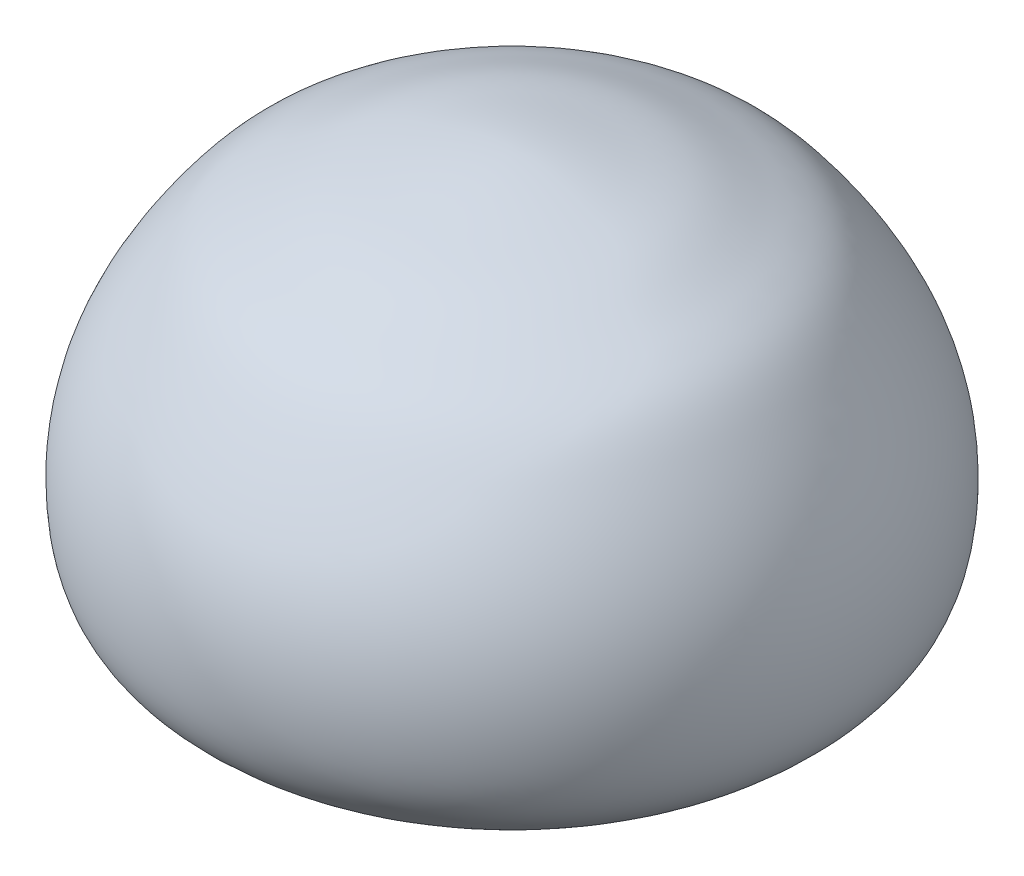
ISO-10303-21;
HEADER;
FILE_DESCRIPTION(('STEP AP214'),'2;1');
FILE_NAME('part.step','',(''),(''),'','','');
FILE_SCHEMA(('AUTOMOTIVE_DESIGN { 1 0 10303 214 1 1 1 1 }'));
ENDSEC;
DATA;
#1=APPLICATION_CONTEXT('core data for automotive mechanical design processes');
#2=APPLICATION_PROTOCOL_DEFINITION('international standard','automotive_design',2000,#1);
#3=PRODUCT_CONTEXT('',#1,'mechanical');
#4=PRODUCT('Part','Part','',(#3));
#5=PRODUCT_RELATED_PRODUCT_CATEGORY('part','',(#4));
#6=PRODUCT_DEFINITION_FORMATION('','',#4);
#7=PRODUCT_DEFINITION_CONTEXT('part definition',#1,'design');
#8=PRODUCT_DEFINITION('design','',#6,#7);
#9=PRODUCT_DEFINITION_SHAPE('','',#8);
#10=(LENGTH_UNIT() NAMED_UNIT(*) SI_UNIT(.MILLI.,.METRE.));
#11=(NAMED_UNIT(*) PLANE_ANGLE_UNIT() SI_UNIT($,.RADIAN.));
#12=(NAMED_UNIT(*) SI_UNIT($,.STERADIAN.) SOLID_ANGLE_UNIT());
#13=UNCERTAINTY_MEASURE_WITH_UNIT(LENGTH_MEASURE(1.E-05),#10,'distance_accuracy_value','');
#14=(GEOMETRIC_REPRESENTATION_CONTEXT(3) GLOBAL_UNCERTAINTY_ASSIGNED_CONTEXT((#13)) GLOBAL_UNIT_ASSIGNED_CONTEXT((#10,
#11,#12)) REPRESENTATION_CONTEXT('',''));
#15=CARTESIAN_POINT('',(0.,0.,0.));
#16=DIRECTION('',(0.,0.,1.));
#17=DIRECTION('',(1.,0.,0.));
#18=AXIS2_PLACEMENT_3D('',#15,#16,#17);
#19=CARTESIAN_POINT('',(601.21452704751,424.085522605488,0.));
#20=CARTESIAN_POINT('',(597.223747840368,424.06266701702,0.));
#21=CARTESIAN_POINT('',(590.988006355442,422.756573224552,0.));
#22=CARTESIAN_POINT('',(582.882262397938,420.894051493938,0.));
#23=CARTESIAN_POINT('',(576.663631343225,417.907629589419,0.));
#24=CARTESIAN_POINT('',(570.130167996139,415.10914255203,0.));
#25=CARTESIAN_POINT('',(563.719945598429,407.308253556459,0.));
#26=CARTESIAN_POINT('',(557.857667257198,397.343587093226,0.));
#27=CARTESIAN_POINT('',(556.311075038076,385.388947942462,0.));
#28=CARTESIAN_POINT('',(558.487684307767,374.050311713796,0.));
#29=CARTESIAN_POINT('',(565.472641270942,370.249337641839,0.));
#30=CARTESIAN_POINT('',(569.286388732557,369.0579215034,0.));
#31=B_SPLINE_CURVE_WITH_KNOTS('',3,(#19,#20,#21,#22,#23,#24,#25,#26,#27,#28,#29,#30),
.UNSPECIFIED.,.F.,.F.,(4,1,1,1,1,1,1,1,1,4),(0.,0.0737818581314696,0.112482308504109,
0.150453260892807,0.198700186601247,0.238423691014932,0.33041749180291,0.404214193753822,
0.453466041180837,0.529347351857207),.UNSPECIFIED.);
#32=CARTESIAN_POINT('',(601.21452704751,369.0579215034,0.));
#33=DIRECTION('',(0.,-1.,0.));
#34=AXIS1_PLACEMENT('',#32,#33);
#35=SURFACE_OF_REVOLUTION('',#31,#34);
#36=CARTESIAN_POINT('',(601.21452704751,369.0579215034,0.));
#37=DIRECTION('',(0.,-1.,0.));
#38=DIRECTION('',(0.,0.,-1.));
#39=AXIS2_PLACEMENT_3D('',#36,#37,#38);
#40=CIRCLE('',#39,31.9281383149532);
#41=CARTESIAN_POINT('',(601.21452704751,369.0579215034,-31.9281383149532));
#42=VERTEX_POINT('',#41);
#43=EDGE_CURVE('E11',#42,#42,#40,.T.);
#44=ORIENTED_EDGE('',*,*,#43,.F.);
#45=EDGE_LOOP('',(#44));
#46=FACE_BOUND('',#45,.T.);
#47=CARTESIAN_POINT('',(601.21452704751,424.085522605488,0.));
#48=VERTEX_POINT('',#47);
#49=VERTEX_LOOP('',#48);
#50=FACE_BOUND('',#49,.T.);
#51=ADVANCED_FACE('F32',(#46,#50),#35,.T.);
#52=CARTESIAN_POINT('',(569.286388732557,369.0579215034,0.));
#53=DIRECTION('',(0.,1.,0.));
#54=DIRECTION('',(0.,0.,1.));
#55=AXIS2_PLACEMENT_3D('',#52,#53,#54);
#56=PLANE('',#55);
#57=ORIENTED_EDGE('',*,*,#43,.T.);
#58=EDGE_LOOP('',(#57));
#59=FACE_BOUND('',#58,.T.);
#60=ADVANCED_FACE('F41',(#59),#56,.F.);
#61=CLOSED_SHELL('',(#51,#60));
#62=MANIFOLD_SOLID_BREP('B2',#61);
#63=ADVANCED_BREP_SHAPE_REPRESENTATION('',(#18,#62),#14);
#64=SHAPE_DEFINITION_REPRESENTATION(#9,#63);
ENDSEC;
END-ISO-10303-21;
